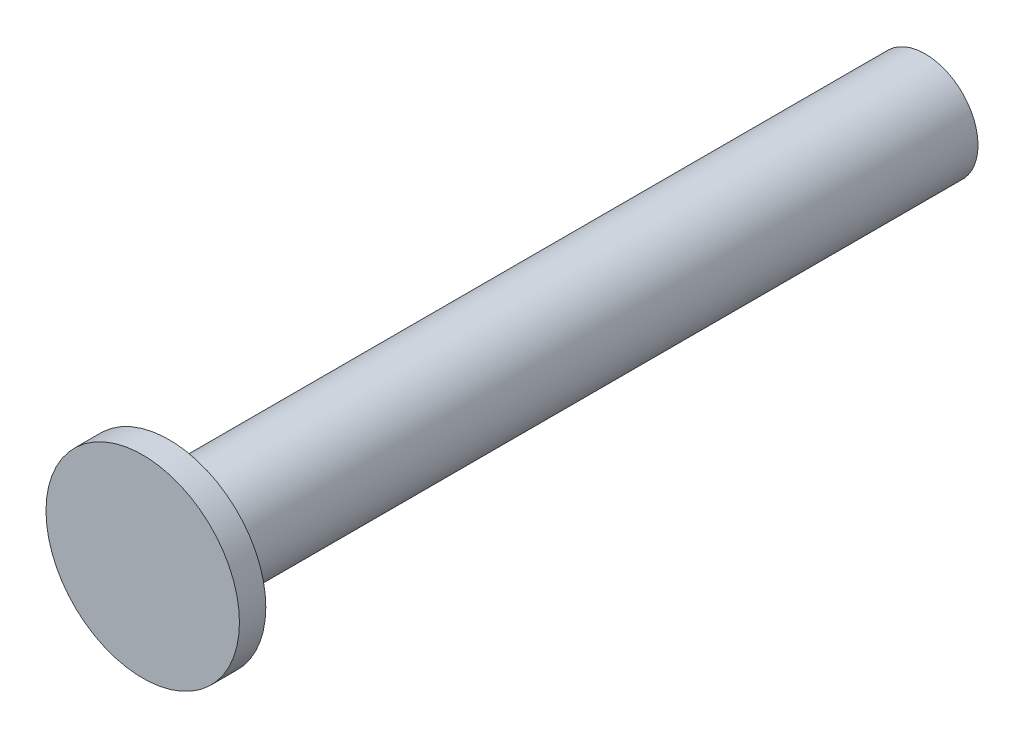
from build123d import *

# Parameters (mm, degrees)
ESQUISSE1_R        = 3
BOSS_EXTRU_1_DEPTH = 43
ESQUISSE2_R        = 5.5
BOSS_EXTRU_2_DEPTH = 1.5


with BuildPart() as part:
    # Esquisse1 → Boss.-Extru.1 (new body)
    with BuildSketch(Plane.XY):
        Circle(ESQUISSE1_R)
    extrude(amount=BOSS_EXTRU_1_DEPTH)

    # Esquisse2 → Boss.-Extru.2 (add)
    with BuildSketch(Plane.XY.offset(43)):
        Circle(ESQUISSE2_R)
    extrude(amount=BOSS_EXTRU_2_DEPTH)


solid = part.part
